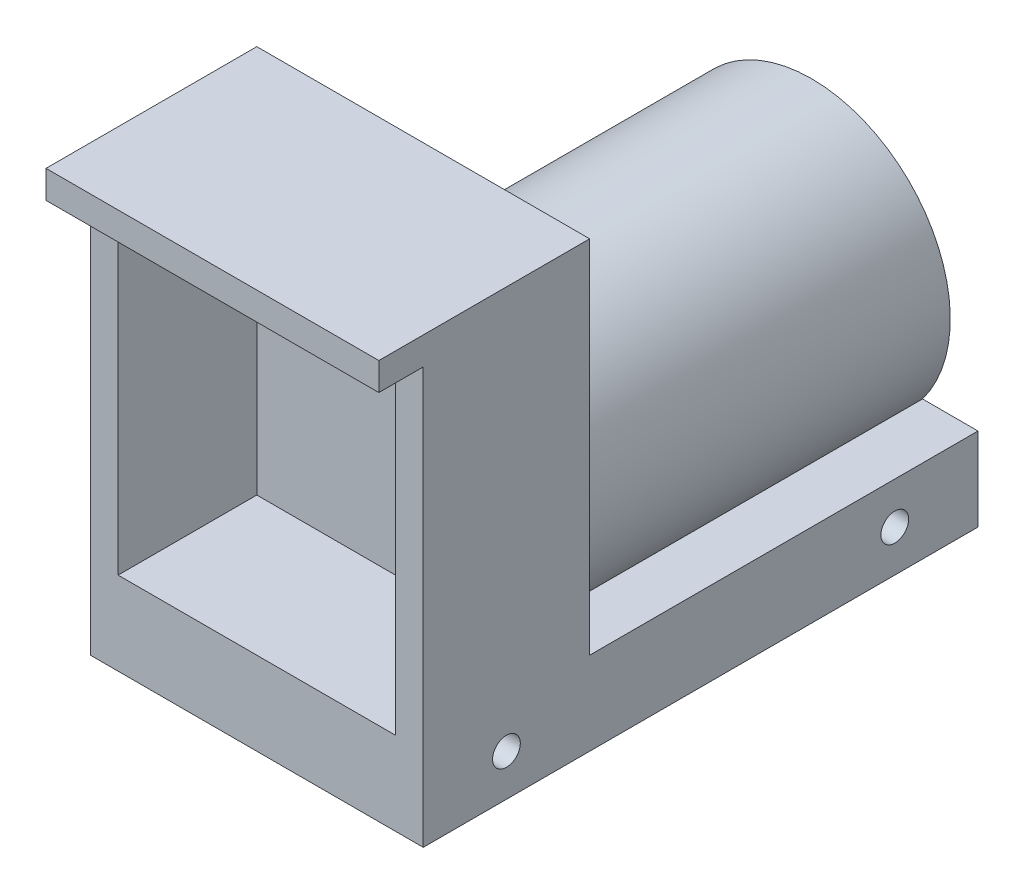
from build123d import *

# Parameters (mm, degrees)
BOSS_EXTRUDE1_DEPTH     = 30
SKETCH2_R               = 25
BOSS_EXTRUDE2_DEPTH     = 70
SKETCH3_W               = 50
SKETCH3_H               = 60
CUT_EXTRUDE1_DEPTH      = 25
CUT_EXTRUDE4_DEPTH      = 104.266645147
CUT_EXTRUDE4_DEPTH_BACK = 104.266645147
SKETCH9_R               = 2.5


with BuildPart() as part:
    # Sketch1 → Boss-Extrude1 (new, symmetric)
    with BuildSketch(Plane(origin=(0, 0, 0), x_dir=(0, 0, -1), z_dir=(1, 0, 0))):
        Polygon((-50, 0), (50, 0), (50, 15), (-20, 15), (-20, 80), (-58, 80), (-58, 75), (-50, 75), align=None)
    extrude(amount=BOSS_EXTRUDE1_DEPTH, both=True)

    # Sketch2 → Boss-Extrude2 (add)
    with BuildSketch(Plane(origin=(0, 0, -50), x_dir=(-1, 0, 0), z_dir=(0, 0, -1))):
        with Locations((0, 30)):
            Circle(SKETCH2_R)
    extrude(amount=-BOSS_EXTRUDE2_DEPTH)

    # Sketch3 → Cut-Extrude1 (cut)
    with BuildSketch(Plane.XY.offset(50)):
        with Locations((0, 45)):
            Rectangle(SKETCH3_W, SKETCH3_H)
    extrude(amount=-CUT_EXTRUDE1_DEPTH, mode=Mode.SUBTRACT)

    # Sketch9 → Cut-Extrude4 (cut, two sides: drawn at the far end of the back side and taken through both)
    with BuildSketch(Plane(origin=(0, 0, 0), x_dir=(0, 0, -1), z_dir=(1, 0, 0)).offset(-CUT_EXTRUDE4_DEPTH_BACK)):
        with Locations((-35, 7.5)):
            Circle(SKETCH9_R)
        with Locations((35, 7.5)):
            Circle(SKETCH9_R)
    extrude(amount=CUT_EXTRUDE4_DEPTH + CUT_EXTRUDE4_DEPTH_BACK, mode=Mode.SUBTRACT)


solid = part.part
